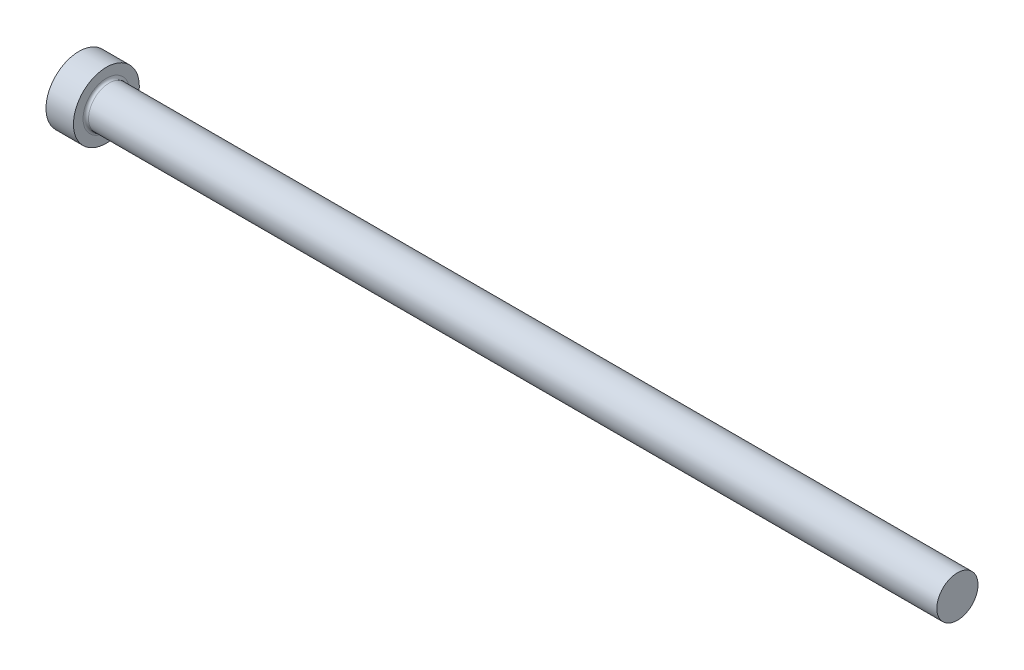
ISO-10303-21;
HEADER;
FILE_DESCRIPTION(('STEP AP214'),'2;1');
FILE_NAME('part.step','',(''),(''),'','','');
FILE_SCHEMA(('AUTOMOTIVE_DESIGN { 1 0 10303 214 1 1 1 1 }'));
ENDSEC;
DATA;
#1=APPLICATION_CONTEXT('core data for automotive mechanical design processes');
#2=APPLICATION_PROTOCOL_DEFINITION('international standard','automotive_design',2000,#1);
#3=PRODUCT_CONTEXT('',#1,'mechanical');
#4=PRODUCT('Part','Part','',(#3));
#5=PRODUCT_RELATED_PRODUCT_CATEGORY('part','',(#4));
#6=PRODUCT_DEFINITION_FORMATION('','',#4);
#7=PRODUCT_DEFINITION_CONTEXT('part definition',#1,'design');
#8=PRODUCT_DEFINITION('design','',#6,#7);
#9=PRODUCT_DEFINITION_SHAPE('','',#8);
#10=(LENGTH_UNIT() NAMED_UNIT(*) SI_UNIT(.MILLI.,.METRE.));
#11=(NAMED_UNIT(*) PLANE_ANGLE_UNIT() SI_UNIT($,.RADIAN.));
#12=(NAMED_UNIT(*) SI_UNIT($,.STERADIAN.) SOLID_ANGLE_UNIT());
#13=UNCERTAINTY_MEASURE_WITH_UNIT(LENGTH_MEASURE(1.E-05),#10,'distance_accuracy_value','');
#14=(GEOMETRIC_REPRESENTATION_CONTEXT(3) GLOBAL_UNCERTAINTY_ASSIGNED_CONTEXT((#13)) GLOBAL_UNIT_ASSIGNED_CONTEXT((#10,
#11,#12)) REPRESENTATION_CONTEXT('',''));
#15=CARTESIAN_POINT('',(0.,0.,0.));
#16=DIRECTION('',(0.,0.,1.));
#17=DIRECTION('',(1.,0.,0.));
#18=AXIS2_PLACEMENT_3D('',#15,#16,#17);
#19=CARTESIAN_POINT('',(0.,0.,0.));
#20=DIRECTION('',(-1.,0.,0.));
#21=DIRECTION('',(0.,-1.,0.));
#22=AXIS2_PLACEMENT_3D('',#19,#20,#21);
#23=PLANE('',#22);
#24=CARTESIAN_POINT('',(0.,0.,0.));
#25=DIRECTION('',(1.,0.,0.));
#26=DIRECTION('',(0.,1.,0.));
#27=AXIS2_PLACEMENT_3D('',#24,#25,#26);
#28=CIRCLE('',#27,6.);
#29=CARTESIAN_POINT('',(0.,6.,0.));
#30=VERTEX_POINT('',#29);
#31=EDGE_CURVE('E25',#30,#30,#28,.T.);
#32=ORIENTED_EDGE('',*,*,#31,.F.);
#33=EDGE_LOOP('',(#32));
#34=FACE_BOUND('',#33,.T.);
#35=ADVANCED_FACE('F14',(#34),#23,.T.);
#36=CARTESIAN_POINT('',(160.,0.,0.));
#37=DIRECTION('',(1.,0.,0.));
#38=DIRECTION('',(0.,1.,0.));
#39=AXIS2_PLACEMENT_3D('',#36,#37,#38);
#40=CYLINDRICAL_SURFACE('',#39,6.);
#41=ORIENTED_EDGE('',*,*,#31,.T.);
#42=EDGE_LOOP('',(#41));
#43=FACE_BOUND('',#42,.T.);
#44=CARTESIAN_POINT('',(5.,0.,0.));
#45=DIRECTION('',(1.,0.,0.));
#46=DIRECTION('',(0.,1.,0.));
#47=AXIS2_PLACEMENT_3D('',#44,#45,#46);
#48=CIRCLE('',#47,6.);
#49=CARTESIAN_POINT('',(5.,6.,0.));
#50=VERTEX_POINT('',#49);
#51=EDGE_CURVE('E29',#50,#50,#48,.T.);
#52=ORIENTED_EDGE('',*,*,#51,.F.);
#53=EDGE_LOOP('',(#52));
#54=FACE_BOUND('',#53,.T.);
#55=ADVANCED_FACE('F51',(#43,#54),#40,.T.);
#56=CARTESIAN_POINT('',(5.,6.,0.));
#57=DIRECTION('',(1.,0.,0.));
#58=DIRECTION('',(0.,1.,0.));
#59=AXIS2_PLACEMENT_3D('',#56,#57,#58);
#60=PLANE('',#59);
#61=CARTESIAN_POINT('',(5.,0.,0.));
#62=DIRECTION('',(1.,0.,0.));
#63=DIRECTION('',(0.,1.,0.));
#64=AXIS2_PLACEMENT_3D('',#61,#62,#63);
#65=CIRCLE('',#64,4.24999999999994);
#66=CARTESIAN_POINT('',(5.,4.24999999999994,0.));
#67=VERTEX_POINT('',#66);
#68=EDGE_CURVE('E9',#67,#67,#65,.F.);
#69=ORIENTED_EDGE('',*,*,#68,.T.);
#70=EDGE_LOOP('',(#69));
#71=FACE_BOUND('',#70,.T.);
#72=ORIENTED_EDGE('',*,*,#51,.T.);
#73=EDGE_LOOP('',(#72));
#74=FACE_BOUND('',#73,.T.);
#75=ADVANCED_FACE('F42',(#71,#74),#60,.T.);
#76=CARTESIAN_POINT('',(160.,0.,0.));
#77=DIRECTION('',(1.,0.,0.));
#78=DIRECTION('',(0.,1.,0.));
#79=AXIS2_PLACEMENT_3D('',#76,#77,#78);
#80=CYLINDRICAL_SURFACE('',#79,3.74999999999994);
#81=CARTESIAN_POINT('',(5.5,0.,0.));
#82=DIRECTION('',(1.,0.,0.));
#83=DIRECTION('',(0.,1.,0.));
#84=AXIS2_PLACEMENT_3D('',#81,#82,#83);
#85=CIRCLE('',#84,3.74999999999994);
#86=CARTESIAN_POINT('',(5.5,3.74999999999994,0.));
#87=VERTEX_POINT('',#86);
#88=EDGE_CURVE('E21',#87,#87,#85,.T.);
#89=ORIENTED_EDGE('',*,*,#88,.T.);
#90=EDGE_LOOP('',(#89));
#91=FACE_BOUND('',#90,.T.);
#92=CARTESIAN_POINT('',(160.,0.,0.));
#93=DIRECTION('',(1.,0.,0.));
#94=DIRECTION('',(0.,1.,0.));
#95=AXIS2_PLACEMENT_3D('',#92,#93,#94);
#96=CIRCLE('',#95,3.75);
#97=CARTESIAN_POINT('',(160.,3.75,0.));
#98=VERTEX_POINT('',#97);
#99=EDGE_CURVE('E34',#98,#98,#96,.T.);
#100=ORIENTED_EDGE('',*,*,#99,.F.);
#101=EDGE_LOOP('',(#100));
#102=FACE_BOUND('',#101,.T.);
#103=ADVANCED_FACE('F40',(#91,#102),#80,.T.);
#104=CARTESIAN_POINT('',(160.,3.75,0.));
#105=DIRECTION('',(1.,0.,0.));
#106=DIRECTION('',(0.,1.,0.));
#107=AXIS2_PLACEMENT_3D('',#104,#105,#106);
#108=PLANE('',#107);
#109=ORIENTED_EDGE('',*,*,#99,.T.);
#110=EDGE_LOOP('',(#109));
#111=FACE_BOUND('',#110,.T.);
#112=ADVANCED_FACE('F38',(#111),#108,.T.);
#113=CARTESIAN_POINT('',(5.5,0.,0.));
#114=DIRECTION('',(1.,0.,0.));
#115=DIRECTION('',(0.,1.,0.));
#116=AXIS2_PLACEMENT_3D('',#113,#114,#115);
#117=TOROIDAL_SURFACE('',#116,4.24999999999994,0.5);
#118=ORIENTED_EDGE('',*,*,#68,.F.);
#119=EDGE_LOOP('',(#118));
#120=FACE_BOUND('',#119,.T.);
#121=ORIENTED_EDGE('',*,*,#88,.F.);
#122=EDGE_LOOP('',(#121));
#123=FACE_BOUND('',#122,.T.);
#124=ADVANCED_FACE('F16',(#120,#123),#117,.F.);
#125=CLOSED_SHELL('',(#35,#55,#75,#103,#112,#124));
#126=MANIFOLD_SOLID_BREP('B1',#125);
#127=ADVANCED_BREP_SHAPE_REPRESENTATION('',(#18,#126),#14);
#128=SHAPE_DEFINITION_REPRESENTATION(#9,#127);
ENDSEC;
END-ISO-10303-21;
